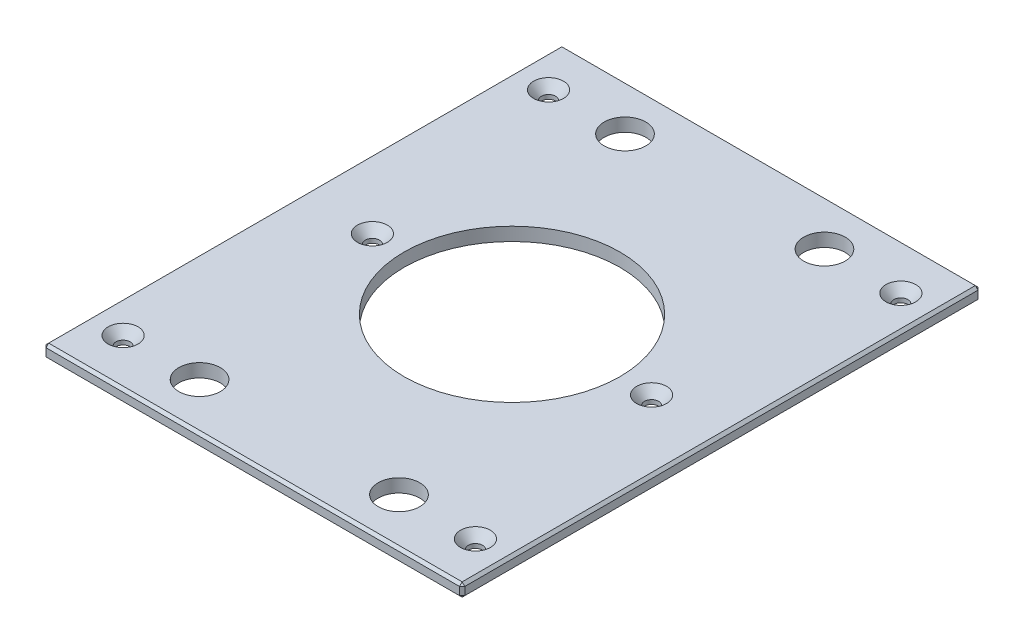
ISO-10303-21;
HEADER;
FILE_DESCRIPTION(('STEP AP214'),'2;1');
FILE_NAME('part.step','',(''),(''),'','','');
FILE_SCHEMA(('AUTOMOTIVE_DESIGN { 1 0 10303 214 1 1 1 1 }'));
ENDSEC;
DATA;
#1=APPLICATION_CONTEXT('core data for automotive mechanical design processes');
#2=APPLICATION_PROTOCOL_DEFINITION('international standard','automotive_design',2000,#1);
#3=PRODUCT_CONTEXT('',#1,'mechanical');
#4=PRODUCT('Part','Part','',(#3));
#5=PRODUCT_RELATED_PRODUCT_CATEGORY('part','',(#4));
#6=PRODUCT_DEFINITION_FORMATION('','',#4);
#7=PRODUCT_DEFINITION_CONTEXT('part definition',#1,'design');
#8=PRODUCT_DEFINITION('design','',#6,#7);
#9=PRODUCT_DEFINITION_SHAPE('','',#8);
#10=(LENGTH_UNIT() NAMED_UNIT(*) SI_UNIT(.MILLI.,.METRE.));
#11=(NAMED_UNIT(*) PLANE_ANGLE_UNIT() SI_UNIT($,.RADIAN.));
#12=(NAMED_UNIT(*) SI_UNIT($,.STERADIAN.) SOLID_ANGLE_UNIT());
#13=UNCERTAINTY_MEASURE_WITH_UNIT(LENGTH_MEASURE(1.E-05),#10,'distance_accuracy_value','');
#14=(GEOMETRIC_REPRESENTATION_CONTEXT(3) GLOBAL_UNCERTAINTY_ASSIGNED_CONTEXT((#13)) GLOBAL_UNIT_ASSIGNED_CONTEXT((#10,
#11,#12)) REPRESENTATION_CONTEXT('',''));
#15=CARTESIAN_POINT('',(0.,0.,0.));
#16=DIRECTION('',(0.,0.,1.));
#17=DIRECTION('',(1.,0.,0.));
#18=AXIS2_PLACEMENT_3D('',#15,#16,#17);
#19=CARTESIAN_POINT('',(-100.0125,6.35,-123.825));
#20=DIRECTION('',(1.,0.,0.));
#21=DIRECTION('',(0.,0.,-1.));
#22=AXIS2_PLACEMENT_3D('',#19,#20,#21);
#23=PLANE('',#22);
#24=DIRECTION('',(0.,0.,-1.));
#25=VECTOR('',#24,1.);
#26=CARTESIAN_POINT('',(-100.0125,5.08000000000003,-123.825));
#27=LINE('',#26,#25);
#28=CARTESIAN_POINT('',(-100.0125,5.08000000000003,122.555));
#29=VERTEX_POINT('',#28);
#30=CARTESIAN_POINT('',(-100.0125,5.08000000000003,-122.555));
#31=VERTEX_POINT('',#30);
#32=EDGE_CURVE('E135',#29,#31,#27,.T.);
#33=ORIENTED_EDGE('',*,*,#32,.T.);
#34=DIRECTION('',(0.,-1.,0.));
#35=VECTOR('',#34,1.);
#36=CARTESIAN_POINT('',(-100.0125,6.35,-122.555));
#37=LINE('',#36,#35);
#38=CARTESIAN_POINT('',(-100.0125,1.26999999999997,-122.555));
#39=VERTEX_POINT('',#38);
#40=EDGE_CURVE('E131',#31,#39,#37,.T.);
#41=ORIENTED_EDGE('',*,*,#40,.T.);
#42=DIRECTION('',(0.,0.,1.));
#43=VECTOR('',#42,1.);
#44=CARTESIAN_POINT('',(-100.0125,1.26999999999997,-123.825));
#45=LINE('',#44,#43);
#46=CARTESIAN_POINT('',(-100.0125,1.26999999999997,122.555));
#47=VERTEX_POINT('',#46);
#48=EDGE_CURVE('E126',#39,#47,#45,.T.);
#49=ORIENTED_EDGE('',*,*,#48,.T.);
#50=DIRECTION('',(0.,1.,0.));
#51=VECTOR('',#50,1.);
#52=CARTESIAN_POINT('',(-100.0125,6.35,122.555));
#53=LINE('',#52,#51);
#54=EDGE_CURVE('E128',#47,#29,#53,.T.);
#55=ORIENTED_EDGE('',*,*,#54,.T.);
#56=EDGE_LOOP('',(#33,#41,#49,#55));
#57=FACE_BOUND('',#56,.T.);
#58=ADVANCED_FACE('F35',(#57),#23,.F.);
#59=CARTESIAN_POINT('',(-100.0125,6.35,123.825));
#60=DIRECTION('',(0.,0.,-1.));
#61=DIRECTION('',(-1.,0.,0.));
#62=AXIS2_PLACEMENT_3D('',#59,#60,#61);
#63=PLANE('',#62);
#64=DIRECTION('',(1.,0.,0.));
#65=VECTOR('',#64,1.);
#66=CARTESIAN_POINT('',(-100.0125,1.26999999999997,123.825));
#67=LINE('',#66,#65);
#68=CARTESIAN_POINT('',(-98.7425000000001,1.26999999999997,123.825));
#69=VERTEX_POINT('',#68);
#70=CARTESIAN_POINT('',(98.7425000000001,1.26999999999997,123.825));
#71=VERTEX_POINT('',#70);
#72=EDGE_CURVE('E58',#69,#71,#67,.T.);
#73=ORIENTED_EDGE('',*,*,#72,.T.);
#74=DIRECTION('',(0.,1.,0.));
#75=VECTOR('',#74,1.);
#76=CARTESIAN_POINT('',(98.7425000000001,6.35,123.825));
#77=LINE('',#76,#75);
#78=CARTESIAN_POINT('',(98.7425000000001,5.08000000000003,123.825));
#79=VERTEX_POINT('',#78);
#80=EDGE_CURVE('E11',#71,#79,#77,.T.);
#81=ORIENTED_EDGE('',*,*,#80,.T.);
#82=DIRECTION('',(-1.,0.,0.));
#83=VECTOR('',#82,1.);
#84=CARTESIAN_POINT('',(-100.0125,5.08000000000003,123.825));
#85=LINE('',#84,#83);
#86=CARTESIAN_POINT('',(-98.7425000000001,5.08000000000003,123.825));
#87=VERTEX_POINT('',#86);
#88=EDGE_CURVE('E44',#79,#87,#85,.T.);
#89=ORIENTED_EDGE('',*,*,#88,.T.);
#90=DIRECTION('',(0.,-1.,0.));
#91=VECTOR('',#90,1.);
#92=CARTESIAN_POINT('',(-98.7425000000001,6.35,123.825));
#93=LINE('',#92,#91);
#94=EDGE_CURVE('E279',#87,#69,#93,.T.);
#95=ORIENTED_EDGE('',*,*,#94,.T.);
#96=EDGE_LOOP('',(#73,#81,#89,#95));
#97=FACE_BOUND('',#96,.T.);
#98=ADVANCED_FACE('F348',(#97),#63,.F.);
#99=CARTESIAN_POINT('',(100.0125,6.35,-123.825));
#100=DIRECTION('',(-1.,0.,0.));
#101=DIRECTION('',(0.,0.,1.));
#102=AXIS2_PLACEMENT_3D('',#99,#100,#101);
#103=PLANE('',#102);
#104=DIRECTION('',(0.,0.,-1.));
#105=VECTOR('',#104,1.);
#106=CARTESIAN_POINT('',(100.0125,1.26999999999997,-123.825));
#107=LINE('',#106,#105);
#108=CARTESIAN_POINT('',(100.0125,1.26999999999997,122.555));
#109=VERTEX_POINT('',#108);
#110=CARTESIAN_POINT('',(100.0125,1.26999999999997,-122.555));
#111=VERTEX_POINT('',#110);
#112=EDGE_CURVE('E274',#109,#111,#107,.T.);
#113=ORIENTED_EDGE('',*,*,#112,.T.);
#114=DIRECTION('',(0.,1.,0.));
#115=VECTOR('',#114,1.);
#116=CARTESIAN_POINT('',(100.0125,6.35,-122.555));
#117=LINE('',#116,#115);
#118=CARTESIAN_POINT('',(100.0125,5.08000000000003,-122.555));
#119=VERTEX_POINT('',#118);
#120=EDGE_CURVE('E276',#111,#119,#117,.T.);
#121=ORIENTED_EDGE('',*,*,#120,.T.);
#122=DIRECTION('',(0.,0.,1.));
#123=VECTOR('',#122,1.);
#124=CARTESIAN_POINT('',(100.0125,5.08000000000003,123.825));
#125=LINE('',#124,#123);
#126=CARTESIAN_POINT('',(100.0125,5.08000000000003,122.555));
#127=VERTEX_POINT('',#126);
#128=EDGE_CURVE('E272',#119,#127,#125,.T.);
#129=ORIENTED_EDGE('',*,*,#128,.T.);
#130=DIRECTION('',(0.,-1.,0.));
#131=VECTOR('',#130,1.);
#132=CARTESIAN_POINT('',(100.0125,6.35,122.555));
#133=LINE('',#132,#131);
#134=EDGE_CURVE('E270',#127,#109,#133,.T.);
#135=ORIENTED_EDGE('',*,*,#134,.T.);
#136=EDGE_LOOP('',(#113,#121,#129,#135));
#137=FACE_BOUND('',#136,.T.);
#138=ADVANCED_FACE('F335',(#137),#103,.F.);
#139=CARTESIAN_POINT('',(-100.0125,6.35,-123.825));
#140=DIRECTION('',(0.,0.,1.));
#141=DIRECTION('',(1.,0.,0.));
#142=AXIS2_PLACEMENT_3D('',#139,#140,#141);
#143=PLANE('',#142);
#144=DIRECTION('',(-1.,0.,0.));
#145=VECTOR('',#144,1.);
#146=CARTESIAN_POINT('',(-100.0125,1.26999999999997,-123.825));
#147=LINE('',#146,#145);
#148=CARTESIAN_POINT('',(98.7425000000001,1.26999999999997,-123.825));
#149=VERTEX_POINT('',#148);
#150=CARTESIAN_POINT('',(-98.7425000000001,1.26999999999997,-123.825));
#151=VERTEX_POINT('',#150);
#152=EDGE_CURVE('E246',#149,#151,#147,.T.);
#153=ORIENTED_EDGE('',*,*,#152,.T.);
#154=DIRECTION('',(0.,1.,0.));
#155=VECTOR('',#154,1.);
#156=CARTESIAN_POINT('',(-98.7425000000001,6.35,-123.825));
#157=LINE('',#156,#155);
#158=CARTESIAN_POINT('',(-98.7425000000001,5.08000000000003,-123.825));
#159=VERTEX_POINT('',#158);
#160=EDGE_CURVE('E250',#151,#159,#157,.T.);
#161=ORIENTED_EDGE('',*,*,#160,.T.);
#162=DIRECTION('',(1.,0.,0.));
#163=VECTOR('',#162,1.);
#164=CARTESIAN_POINT('',(100.0125,5.08000000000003,-123.825));
#165=LINE('',#164,#163);
#166=CARTESIAN_POINT('',(98.7425000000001,5.08000000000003,-123.825));
#167=VERTEX_POINT('',#166);
#168=EDGE_CURVE('E248',#159,#167,#165,.T.);
#169=ORIENTED_EDGE('',*,*,#168,.T.);
#170=DIRECTION('',(0.,-1.,0.));
#171=VECTOR('',#170,1.);
#172=CARTESIAN_POINT('',(98.7425000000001,6.35,-123.825));
#173=LINE('',#172,#171);
#174=EDGE_CURVE('E244',#167,#149,#173,.T.);
#175=ORIENTED_EDGE('',*,*,#174,.T.);
#176=EDGE_LOOP('',(#153,#161,#169,#175));
#177=FACE_BOUND('',#176,.T.);
#178=ADVANCED_FACE('F309',(#177),#143,.F.);
#179=CARTESIAN_POINT('',(0.,6.35,0.));
#180=DIRECTION('',(0.,1.,0.));
#181=DIRECTION('',(0.,0.,1.));
#182=AXIS2_PLACEMENT_3D('',#179,#180,#181);
#183=PLANE('',#182);
#184=CARTESIAN_POINT('',(84.1375,6.35,-101.6));
#185=DIRECTION('',(0.,1.,0.));
#186=DIRECTION('',(0.,0.,1.));
#187=AXIS2_PLACEMENT_3D('',#184,#185,#186);
#188=CIRCLE('',#187,7.1374);
#189=CARTESIAN_POINT('',(84.1375,6.35,-94.4626));
#190=VERTEX_POINT('',#189);
#191=EDGE_CURVE('E752',#190,#190,#188,.T.);
#192=ORIENTED_EDGE('',*,*,#191,.F.);
#193=EDGE_LOOP('',(#192));
#194=FACE_BOUND('',#193,.T.);
#195=CARTESIAN_POINT('',(84.1375,6.35,101.6));
#196=DIRECTION('',(0.,1.,0.));
#197=DIRECTION('',(0.,0.,1.));
#198=AXIS2_PLACEMENT_3D('',#195,#196,#197);
#199=CIRCLE('',#198,7.1374);
#200=CARTESIAN_POINT('',(84.1375,6.35,108.7374));
#201=VERTEX_POINT('',#200);
#202=EDGE_CURVE('E756',#201,#201,#199,.T.);
#203=ORIENTED_EDGE('',*,*,#202,.F.);
#204=EDGE_LOOP('',(#203));
#205=FACE_BOUND('',#204,.T.);
#206=CARTESIAN_POINT('',(-84.1375,6.35,101.6));
#207=DIRECTION('',(0.,1.,0.));
#208=DIRECTION('',(0.,0.,1.));
#209=AXIS2_PLACEMENT_3D('',#206,#207,#208);
#210=CIRCLE('',#209,7.1374);
#211=CARTESIAN_POINT('',(-84.1375,6.35,108.7374));
#212=VERTEX_POINT('',#211);
#213=EDGE_CURVE('E760',#212,#212,#210,.T.);
#214=ORIENTED_EDGE('',*,*,#213,.F.);
#215=EDGE_LOOP('',(#214));
#216=FACE_BOUND('',#215,.T.);
#217=CARTESIAN_POINT('',(-66.675,6.35,0.));
#218=DIRECTION('',(0.,1.,0.));
#219=DIRECTION('',(0.,0.,1.));
#220=AXIS2_PLACEMENT_3D('',#217,#218,#219);
#221=CIRCLE('',#220,7.1374);
#222=CARTESIAN_POINT('',(-66.675,6.35,7.1374));
#223=VERTEX_POINT('',#222);
#224=EDGE_CURVE('E764',#223,#223,#221,.T.);
#225=ORIENTED_EDGE('',*,*,#224,.F.);
#226=EDGE_LOOP('',(#225));
#227=FACE_BOUND('',#226,.T.);
#228=CARTESIAN_POINT('',(66.675,6.35,0.));
#229=DIRECTION('',(0.,1.,0.));
#230=DIRECTION('',(0.,0.,1.));
#231=AXIS2_PLACEMENT_3D('',#228,#229,#230);
#232=CIRCLE('',#231,7.1374);
#233=CARTESIAN_POINT('',(66.675,6.35,7.1374));
#234=VERTEX_POINT('',#233);
#235=EDGE_CURVE('E768',#234,#234,#232,.T.);
#236=ORIENTED_EDGE('',*,*,#235,.F.);
#237=EDGE_LOOP('',(#236));
#238=FACE_BOUND('',#237,.T.);
#239=CARTESIAN_POINT('',(-84.1375,6.35,-101.6));
#240=DIRECTION('',(0.,1.,0.));
#241=DIRECTION('',(0.,0.,1.));
#242=AXIS2_PLACEMENT_3D('',#239,#240,#241);
#243=CIRCLE('',#242,7.1374);
#244=CARTESIAN_POINT('',(-84.1375,6.35,-94.4626));
#245=VERTEX_POINT('',#244);
#246=EDGE_CURVE('E771',#245,#245,#243,.T.);
#247=ORIENTED_EDGE('',*,*,#246,.F.);
#248=EDGE_LOOP('',(#247));
#249=FACE_BOUND('',#248,.T.);
#250=DIRECTION('',(0.,0.,-1.));
#251=VECTOR('',#250,1.);
#252=CARTESIAN_POINT('',(98.7425000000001,6.35,-123.825));
#253=LINE('',#252,#251);
#254=CARTESIAN_POINT('',(98.7425000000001,6.35,122.555));
#255=VERTEX_POINT('',#254);
#256=CARTESIAN_POINT('',(98.7425000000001,6.35,-122.555));
#257=VERTEX_POINT('',#256);
#258=EDGE_CURVE('E257',#255,#257,#253,.T.);
#259=ORIENTED_EDGE('',*,*,#258,.T.);
#260=DIRECTION('',(-1.,0.,0.));
#261=VECTOR('',#260,1.);
#262=CARTESIAN_POINT('',(-100.0125,6.35,-122.555));
#263=LINE('',#262,#261);
#264=CARTESIAN_POINT('',(-98.7425000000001,6.35,-122.555));
#265=VERTEX_POINT('',#264);
#266=EDGE_CURVE('E259',#257,#265,#263,.T.);
#267=ORIENTED_EDGE('',*,*,#266,.T.);
#268=DIRECTION('',(0.,0.,1.));
#269=VECTOR('',#268,1.);
#270=CARTESIAN_POINT('',(-98.7425000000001,6.35,123.825));
#271=LINE('',#270,#269);
#272=CARTESIAN_POINT('',(-98.7425000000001,6.35,122.555));
#273=VERTEX_POINT('',#272);
#274=EDGE_CURVE('E255',#265,#273,#271,.T.);
#275=ORIENTED_EDGE('',*,*,#274,.T.);
#276=DIRECTION('',(1.,0.,0.));
#277=VECTOR('',#276,1.);
#278=CARTESIAN_POINT('',(100.0125,6.35,122.555));
#279=LINE('',#278,#277);
#280=EDGE_CURVE('E253',#273,#255,#279,.T.);
#281=ORIENTED_EDGE('',*,*,#280,.T.);
#282=EDGE_LOOP('',(#259,#267,#275,#281));
#283=FACE_BOUND('',#282,.T.);
#284=CARTESIAN_POINT('',(47.625,6.35,-101.6));
#285=DIRECTION('',(0.,1.,0.));
#286=DIRECTION('',(0.,0.,1.));
#287=AXIS2_PLACEMENT_3D('',#284,#285,#286);
#288=CIRCLE('',#287,9.921875);
#289=CARTESIAN_POINT('',(47.625,6.35,-91.678125));
#290=VERTEX_POINT('',#289);
#291=EDGE_CURVE('E204',#290,#290,#288,.T.);
#292=ORIENTED_EDGE('',*,*,#291,.F.);
#293=EDGE_LOOP('',(#292));
#294=FACE_BOUND('',#293,.T.);
#295=CARTESIAN_POINT('',(-47.625,6.35,-101.6));
#296=DIRECTION('',(0.,1.,0.));
#297=DIRECTION('',(0.,0.,1.));
#298=AXIS2_PLACEMENT_3D('',#295,#296,#297);
#299=CIRCLE('',#298,9.921875);
#300=CARTESIAN_POINT('',(-47.625,6.35,-91.678125));
#301=VERTEX_POINT('',#300);
#302=EDGE_CURVE('E214',#301,#301,#299,.T.);
#303=ORIENTED_EDGE('',*,*,#302,.F.);
#304=EDGE_LOOP('',(#303));
#305=FACE_BOUND('',#304,.T.);
#306=CARTESIAN_POINT('',(47.625,6.35,101.6));
#307=DIRECTION('',(0.,1.,0.));
#308=DIRECTION('',(0.,0.,1.));
#309=AXIS2_PLACEMENT_3D('',#306,#307,#308);
#310=CIRCLE('',#309,9.921875);
#311=CARTESIAN_POINT('',(47.625,6.35,111.521875));
#312=VERTEX_POINT('',#311);
#313=EDGE_CURVE('E225',#312,#312,#310,.T.);
#314=ORIENTED_EDGE('',*,*,#313,.F.);
#315=EDGE_LOOP('',(#314));
#316=FACE_BOUND('',#315,.T.);
#317=CARTESIAN_POINT('',(-47.625,6.35,101.6));
#318=DIRECTION('',(0.,1.,0.));
#319=DIRECTION('',(0.,0.,1.));
#320=AXIS2_PLACEMENT_3D('',#317,#318,#319);
#321=CIRCLE('',#320,9.921875);
#322=CARTESIAN_POINT('',(-47.625,6.35,111.521875));
#323=VERTEX_POINT('',#322);
#324=EDGE_CURVE('E231',#323,#323,#321,.T.);
#325=ORIENTED_EDGE('',*,*,#324,.F.);
#326=EDGE_LOOP('',(#325));
#327=FACE_BOUND('',#326,.T.);
#328=CARTESIAN_POINT('',(0.,6.35,0.));
#329=DIRECTION('',(0.,1.,0.));
#330=DIRECTION('',(0.,0.,1.));
#331=AXIS2_PLACEMENT_3D('',#328,#329,#330);
#332=CIRCLE('',#331,51.562);
#333=CARTESIAN_POINT('',(0.,6.35,51.562));
#334=VERTEX_POINT('',#333);
#335=EDGE_CURVE('E237',#334,#334,#332,.T.);
#336=ORIENTED_EDGE('',*,*,#335,.F.);
#337=EDGE_LOOP('',(#336));
#338=FACE_BOUND('',#337,.T.);
#339=ADVANCED_FACE('F357',(#194,#205,#216,#227,#238,#249,#283,#294,#305,#316,#327,#338),#183,.T.);
#340=CARTESIAN_POINT('',(0.,0.,0.));
#341=DIRECTION('',(0.,1.,0.));
#342=DIRECTION('',(0.,0.,1.));
#343=AXIS2_PLACEMENT_3D('',#340,#341,#342);
#344=PLANE('',#343);
#345=CARTESIAN_POINT('',(84.1375,0.,-101.6));
#346=DIRECTION('',(0.,1.,0.));
#347=DIRECTION('',(0.,0.,1.));
#348=AXIS2_PLACEMENT_3D('',#345,#346,#347);
#349=CIRCLE('',#348,3.3782);
#350=CARTESIAN_POINT('',(84.1375,0.,-98.2218));
#351=VERTEX_POINT('',#350);
#352=EDGE_CURVE('E805',#351,#351,#349,.T.);
#353=ORIENTED_EDGE('',*,*,#352,.T.);
#354=EDGE_LOOP('',(#353));
#355=FACE_BOUND('',#354,.T.);
#356=CARTESIAN_POINT('',(84.1375,0.,101.6));
#357=DIRECTION('',(0.,1.,0.));
#358=DIRECTION('',(0.,0.,1.));
#359=AXIS2_PLACEMENT_3D('',#356,#357,#358);
#360=CIRCLE('',#359,3.3782);
#361=CARTESIAN_POINT('',(84.1375,0.,104.9782));
#362=VERTEX_POINT('',#361);
#363=EDGE_CURVE('E798',#362,#362,#360,.T.);
#364=ORIENTED_EDGE('',*,*,#363,.T.);
#365=EDGE_LOOP('',(#364));
#366=FACE_BOUND('',#365,.T.);
#367=CARTESIAN_POINT('',(-84.1375,0.,101.6));
#368=DIRECTION('',(0.,1.,0.));
#369=DIRECTION('',(0.,0.,1.));
#370=AXIS2_PLACEMENT_3D('',#367,#368,#369);
#371=CIRCLE('',#370,3.3782);
#372=CARTESIAN_POINT('',(-84.1375,0.,104.9782));
#373=VERTEX_POINT('',#372);
#374=EDGE_CURVE('E791',#373,#373,#371,.T.);
#375=ORIENTED_EDGE('',*,*,#374,.T.);
#376=EDGE_LOOP('',(#375));
#377=FACE_BOUND('',#376,.T.);
#378=CARTESIAN_POINT('',(-66.675,0.,0.));
#379=DIRECTION('',(0.,1.,0.));
#380=DIRECTION('',(0.,0.,1.));
#381=AXIS2_PLACEMENT_3D('',#378,#379,#380);
#382=CIRCLE('',#381,3.3782);
#383=CARTESIAN_POINT('',(-66.675,0.,3.3782));
#384=VERTEX_POINT('',#383);
#385=EDGE_CURVE('E784',#384,#384,#382,.T.);
#386=ORIENTED_EDGE('',*,*,#385,.T.);
#387=EDGE_LOOP('',(#386));
#388=FACE_BOUND('',#387,.T.);
#389=CARTESIAN_POINT('',(66.675,0.,0.));
#390=DIRECTION('',(0.,1.,0.));
#391=DIRECTION('',(0.,0.,1.));
#392=AXIS2_PLACEMENT_3D('',#389,#390,#391);
#393=CIRCLE('',#392,3.3782);
#394=CARTESIAN_POINT('',(66.675,0.,3.3782));
#395=VERTEX_POINT('',#394);
#396=EDGE_CURVE('E774',#395,#395,#393,.T.);
#397=ORIENTED_EDGE('',*,*,#396,.T.);
#398=EDGE_LOOP('',(#397));
#399=FACE_BOUND('',#398,.T.);
#400=CARTESIAN_POINT('',(-84.1375,0.,-101.6));
#401=DIRECTION('',(0.,1.,0.));
#402=DIRECTION('',(0.,0.,1.));
#403=AXIS2_PLACEMENT_3D('',#400,#401,#402);
#404=CIRCLE('',#403,3.3782);
#405=CARTESIAN_POINT('',(-84.1375,0.,-98.2218));
#406=VERTEX_POINT('',#405);
#407=EDGE_CURVE('E217',#406,#406,#404,.T.);
#408=ORIENTED_EDGE('',*,*,#407,.T.);
#409=EDGE_LOOP('',(#408));
#410=FACE_BOUND('',#409,.T.);
#411=DIRECTION('',(0.,0.,-1.));
#412=VECTOR('',#411,1.);
#413=CARTESIAN_POINT('',(-98.7425000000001,0.,0.));
#414=LINE('',#413,#412);
#415=CARTESIAN_POINT('',(-98.7425000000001,0.,122.555));
#416=VERTEX_POINT('',#415);
#417=CARTESIAN_POINT('',(-98.7425000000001,0.,-122.555));
#418=VERTEX_POINT('',#417);
#419=EDGE_CURVE('E158',#416,#418,#414,.T.);
#420=ORIENTED_EDGE('',*,*,#419,.T.);
#421=DIRECTION('',(1.,0.,0.));
#422=VECTOR('',#421,1.);
#423=CARTESIAN_POINT('',(0.,0.,-122.555));
#424=LINE('',#423,#422);
#425=CARTESIAN_POINT('',(98.7425000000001,0.,-122.555));
#426=VERTEX_POINT('',#425);
#427=EDGE_CURVE('E267',#418,#426,#424,.T.);
#428=ORIENTED_EDGE('',*,*,#427,.T.);
#429=DIRECTION('',(0.,0.,1.));
#430=VECTOR('',#429,1.);
#431=CARTESIAN_POINT('',(98.7425000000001,0.,0.));
#432=LINE('',#431,#430);
#433=CARTESIAN_POINT('',(98.7425000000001,0.,122.555));
#434=VERTEX_POINT('',#433);
#435=EDGE_CURVE('E265',#426,#434,#432,.T.);
#436=ORIENTED_EDGE('',*,*,#435,.T.);
#437=DIRECTION('',(-1.,0.,0.));
#438=VECTOR('',#437,1.);
#439=CARTESIAN_POINT('',(0.,0.,122.555));
#440=LINE('',#439,#438);
#441=EDGE_CURVE('E262',#434,#416,#440,.T.);
#442=ORIENTED_EDGE('',*,*,#441,.T.);
#443=EDGE_LOOP('',(#420,#428,#436,#442));
#444=FACE_BOUND('',#443,.T.);
#445=CARTESIAN_POINT('',(47.625,0.,-101.6));
#446=DIRECTION('',(0.,1.,0.));
#447=DIRECTION('',(0.,0.,1.));
#448=AXIS2_PLACEMENT_3D('',#445,#446,#447);
#449=CIRCLE('',#448,9.921875);
#450=CARTESIAN_POINT('',(47.625,0.,-91.678125));
#451=VERTEX_POINT('',#450);
#452=EDGE_CURVE('E209',#451,#451,#449,.T.);
#453=ORIENTED_EDGE('',*,*,#452,.T.);
#454=EDGE_LOOP('',(#453));
#455=FACE_BOUND('',#454,.T.);
#456=CARTESIAN_POINT('',(-47.625,0.,-101.6));
#457=DIRECTION('',(0.,1.,0.));
#458=DIRECTION('',(0.,0.,1.));
#459=AXIS2_PLACEMENT_3D('',#456,#457,#458);
#460=CIRCLE('',#459,9.921875);
#461=CARTESIAN_POINT('',(-47.625,0.,-91.678125));
#462=VERTEX_POINT('',#461);
#463=EDGE_CURVE('E222',#462,#462,#460,.T.);
#464=ORIENTED_EDGE('',*,*,#463,.T.);
#465=EDGE_LOOP('',(#464));
#466=FACE_BOUND('',#465,.T.);
#467=CARTESIAN_POINT('',(47.625,0.,101.6));
#468=DIRECTION('',(0.,1.,0.));
#469=DIRECTION('',(0.,0.,1.));
#470=AXIS2_PLACEMENT_3D('',#467,#468,#469);
#471=CIRCLE('',#470,9.921875);
#472=CARTESIAN_POINT('',(47.625,0.,111.521875));
#473=VERTEX_POINT('',#472);
#474=EDGE_CURVE('E228',#473,#473,#471,.T.);
#475=ORIENTED_EDGE('',*,*,#474,.T.);
#476=EDGE_LOOP('',(#475));
#477=FACE_BOUND('',#476,.T.);
#478=CARTESIAN_POINT('',(-47.625,0.,101.6));
#479=DIRECTION('',(0.,1.,0.));
#480=DIRECTION('',(0.,0.,1.));
#481=AXIS2_PLACEMENT_3D('',#478,#479,#480);
#482=CIRCLE('',#481,9.921875);
#483=CARTESIAN_POINT('',(-47.625,0.,111.521875));
#484=VERTEX_POINT('',#483);
#485=EDGE_CURVE('E234',#484,#484,#482,.T.);
#486=ORIENTED_EDGE('',*,*,#485,.T.);
#487=EDGE_LOOP('',(#486));
#488=FACE_BOUND('',#487,.T.);
#489=CARTESIAN_POINT('',(0.,0.,0.));
#490=DIRECTION('',(0.,1.,0.));
#491=DIRECTION('',(0.,0.,1.));
#492=AXIS2_PLACEMENT_3D('',#489,#490,#491);
#493=CIRCLE('',#492,51.562);
#494=CARTESIAN_POINT('',(0.,0.,51.562));
#495=VERTEX_POINT('',#494);
#496=EDGE_CURVE('E147',#495,#495,#493,.T.);
#497=ORIENTED_EDGE('',*,*,#496,.T.);
#498=EDGE_LOOP('',(#497));
#499=FACE_BOUND('',#498,.T.);
#500=ADVANCED_FACE('F322',(#355,#366,#377,#388,#399,#410,#444,#455,#466,#477,#488,#499),#344,.F.);
#501=CARTESIAN_POINT('',(0.,0.,0.));
#502=DIRECTION('',(0.,1.,0.));
#503=DIRECTION('',(0.,0.,1.));
#504=AXIS2_PLACEMENT_3D('',#501,#502,#503);
#505=CYLINDRICAL_SURFACE('',#504,51.562);
#506=ORIENTED_EDGE('',*,*,#496,.F.);
#507=EDGE_LOOP('',(#506));
#508=FACE_BOUND('',#507,.T.);
#509=ORIENTED_EDGE('',*,*,#335,.T.);
#510=EDGE_LOOP('',(#509));
#511=FACE_BOUND('',#510,.T.);
#512=ADVANCED_FACE('F691',(#508,#511),#505,.F.);
#513=CARTESIAN_POINT('',(-47.625,6.35,101.6));
#514=DIRECTION('',(0.,1.,0.));
#515=DIRECTION('',(0.,0.,1.));
#516=AXIS2_PLACEMENT_3D('',#513,#514,#515);
#517=CYLINDRICAL_SURFACE('',#516,9.921875);
#518=ORIENTED_EDGE('',*,*,#485,.F.);
#519=EDGE_LOOP('',(#518));
#520=FACE_BOUND('',#519,.T.);
#521=ORIENTED_EDGE('',*,*,#324,.T.);
#522=EDGE_LOOP('',(#521));
#523=FACE_BOUND('',#522,.T.);
#524=ADVANCED_FACE('F682',(#520,#523),#517,.F.);
#525=CARTESIAN_POINT('',(47.625,6.35,101.6));
#526=DIRECTION('',(0.,1.,0.));
#527=DIRECTION('',(0.,0.,1.));
#528=AXIS2_PLACEMENT_3D('',#525,#526,#527);
#529=CYLINDRICAL_SURFACE('',#528,9.921875);
#530=ORIENTED_EDGE('',*,*,#474,.F.);
#531=EDGE_LOOP('',(#530));
#532=FACE_BOUND('',#531,.T.);
#533=ORIENTED_EDGE('',*,*,#313,.T.);
#534=EDGE_LOOP('',(#533));
#535=FACE_BOUND('',#534,.T.);
#536=ADVANCED_FACE('F673',(#532,#535),#529,.F.);
#537=CARTESIAN_POINT('',(-47.625,6.35,-101.6));
#538=DIRECTION('',(0.,1.,0.));
#539=DIRECTION('',(0.,0.,1.));
#540=AXIS2_PLACEMENT_3D('',#537,#538,#539);
#541=CYLINDRICAL_SURFACE('',#540,9.921875);
#542=ORIENTED_EDGE('',*,*,#463,.F.);
#543=EDGE_LOOP('',(#542));
#544=FACE_BOUND('',#543,.T.);
#545=ORIENTED_EDGE('',*,*,#302,.T.);
#546=EDGE_LOOP('',(#545));
#547=FACE_BOUND('',#546,.T.);
#548=ADVANCED_FACE('F663',(#544,#547),#541,.F.);
#549=CARTESIAN_POINT('',(47.625,6.35,-101.6));
#550=DIRECTION('',(0.,1.,0.));
#551=DIRECTION('',(0.,0.,1.));
#552=AXIS2_PLACEMENT_3D('',#549,#550,#551);
#553=CYLINDRICAL_SURFACE('',#552,9.921875);
#554=ORIENTED_EDGE('',*,*,#452,.F.);
#555=EDGE_LOOP('',(#554));
#556=FACE_BOUND('',#555,.T.);
#557=ORIENTED_EDGE('',*,*,#291,.T.);
#558=EDGE_LOOP('',(#557));
#559=FACE_BOUND('',#558,.T.);
#560=ADVANCED_FACE('F366',(#556,#559),#553,.F.);
#561=CARTESIAN_POINT('',(100.0125,6.35,122.555));
#562=DIRECTION('',(-0.707106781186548,0.,-0.707106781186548));
#563=DIRECTION('',(0.,-1.,0.));
#564=AXIS2_PLACEMENT_3D('',#561,#562,#563);
#565=PLANE('',#564);
#566=DIRECTION('',(-0.707106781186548,0.,0.707106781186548));
#567=VECTOR('',#566,1.);
#568=CARTESIAN_POINT('',(100.0125,5.08000000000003,122.555));
#569=LINE('',#568,#567);
#570=EDGE_CURVE('E39',#79,#127,#569,.F.);
#571=ORIENTED_EDGE('',*,*,#570,.F.);
#572=ORIENTED_EDGE('',*,*,#80,.F.);
#573=DIRECTION('',(0.707106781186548,0.,-0.707106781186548));
#574=VECTOR('',#573,1.);
#575=CARTESIAN_POINT('',(99.3775000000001,1.26999999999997,123.19));
#576=LINE('',#575,#574);
#577=EDGE_CURVE('E197',#109,#71,#576,.F.);
#578=ORIENTED_EDGE('',*,*,#577,.F.);
#579=ORIENTED_EDGE('',*,*,#134,.F.);
#580=EDGE_LOOP('',(#571,#572,#578,#579));
#581=FACE_BOUND('',#580,.T.);
#582=ADVANCED_FACE('F37',(#581),#565,.F.);
#583=CARTESIAN_POINT('',(100.0125,5.08000000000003,122.555));
#584=DIRECTION('',(0.577350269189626,0.577350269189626,0.577350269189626));
#585=DIRECTION('',(0.707106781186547,0.,-0.707106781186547));
#586=AXIS2_PLACEMENT_3D('',#583,#584,#585);
#587=PLANE('',#586);
#588=DIRECTION('',(0.,-0.707106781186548,0.707106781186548));
#589=VECTOR('',#588,1.);
#590=CARTESIAN_POINT('',(98.7425000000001,5.71500000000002,123.19));
#591=LINE('',#590,#589);
#592=EDGE_CURVE('E193',#79,#255,#591,.F.);
#593=ORIENTED_EDGE('',*,*,#592,.F.);
#594=ORIENTED_EDGE('',*,*,#570,.T.);
#595=DIRECTION('',(-0.707106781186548,0.707106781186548,0.));
#596=VECTOR('',#595,1.);
#597=CARTESIAN_POINT('',(100.0125,5.08000000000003,122.555));
#598=LINE('',#597,#596);
#599=EDGE_CURVE('E195',#255,#127,#598,.F.);
#600=ORIENTED_EDGE('',*,*,#599,.F.);
#601=EDGE_LOOP('',(#593,#594,#600));
#602=FACE_BOUND('',#601,.T.);
#603=ADVANCED_FACE('F359',(#602),#587,.T.);
#604=CARTESIAN_POINT('',(98.7425000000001,0.,122.555));
#605=DIRECTION('',(0.577350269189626,-0.577350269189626,0.577350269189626));
#606=DIRECTION('',(0.707106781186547,0.,-0.707106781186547));
#607=AXIS2_PLACEMENT_3D('',#604,#605,#606);
#608=PLANE('',#607);
#609=DIRECTION('',(-0.707106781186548,-0.707106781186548,0.));
#610=VECTOR('',#609,1.);
#611=CARTESIAN_POINT('',(98.7425000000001,0.,122.555));
#612=LINE('',#611,#610);
#613=EDGE_CURVE('E187',#109,#434,#612,.T.);
#614=ORIENTED_EDGE('',*,*,#613,.F.);
#615=ORIENTED_EDGE('',*,*,#577,.T.);
#616=DIRECTION('',(0.,0.707106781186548,0.707106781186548));
#617=VECTOR('',#616,1.);
#618=CARTESIAN_POINT('',(98.7425000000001,0.,122.555));
#619=LINE('',#618,#617);
#620=EDGE_CURVE('E190',#434,#71,#619,.T.);
#621=ORIENTED_EDGE('',*,*,#620,.F.);
#622=EDGE_LOOP('',(#614,#615,#621));
#623=FACE_BOUND('',#622,.T.);
#624=ADVANCED_FACE('F328',(#623),#608,.T.);
#625=CARTESIAN_POINT('',(98.7425000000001,6.35,0.));
#626=DIRECTION('',(0.707106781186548,0.707106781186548,0.));
#627=DIRECTION('',(0.,0.,1.));
#628=AXIS2_PLACEMENT_3D('',#625,#626,#627);
#629=PLANE('',#628);
#630=ORIENTED_EDGE('',*,*,#599,.T.);
#631=ORIENTED_EDGE('',*,*,#128,.F.);
#632=DIRECTION('',(0.707106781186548,-0.707106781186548,0.));
#633=VECTOR('',#632,1.);
#634=CARTESIAN_POINT('',(99.3775000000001,5.71500000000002,-122.555));
#635=LINE('',#634,#633);
#636=EDGE_CURVE('E182',#257,#119,#635,.T.);
#637=ORIENTED_EDGE('',*,*,#636,.F.);
#638=ORIENTED_EDGE('',*,*,#258,.F.);
#639=EDGE_LOOP('',(#630,#631,#637,#638));
#640=FACE_BOUND('',#639,.T.);
#641=ADVANCED_FACE('F345',(#640),#629,.T.);
#642=CARTESIAN_POINT('',(0.,6.35,122.555));
#643=DIRECTION('',(0.,0.707106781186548,0.707106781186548));
#644=DIRECTION('',(-1.,0.,0.));
#645=AXIS2_PLACEMENT_3D('',#642,#643,#644);
#646=PLANE('',#645);
#647=ORIENTED_EDGE('',*,*,#592,.T.);
#648=ORIENTED_EDGE('',*,*,#280,.F.);
#649=DIRECTION('',(0.,0.707106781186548,-0.707106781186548));
#650=VECTOR('',#649,1.);
#651=CARTESIAN_POINT('',(-98.7425000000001,6.35,122.555));
#652=LINE('',#651,#650);
#653=EDGE_CURVE('E179',#87,#273,#652,.T.);
#654=ORIENTED_EDGE('',*,*,#653,.F.);
#655=ORIENTED_EDGE('',*,*,#88,.F.);
#656=EDGE_LOOP('',(#647,#648,#654,#655));
#657=FACE_BOUND('',#656,.T.);
#658=ADVANCED_FACE('F350',(#657),#646,.T.);
#659=CARTESIAN_POINT('',(-98.7425000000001,6.35,123.825));
#660=DIRECTION('',(0.707106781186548,0.,-0.707106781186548));
#661=DIRECTION('',(0.,-1.,0.));
#662=AXIS2_PLACEMENT_3D('',#659,#660,#661);
#663=PLANE('',#662);
#664=DIRECTION('',(0.707106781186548,0.,0.707106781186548));
#665=VECTOR('',#664,1.);
#666=CARTESIAN_POINT('',(-100.0125,1.26999999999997,122.555));
#667=LINE('',#666,#665);
#668=EDGE_CURVE('E142',#69,#47,#667,.F.);
#669=ORIENTED_EDGE('',*,*,#668,.F.);
#670=ORIENTED_EDGE('',*,*,#94,.F.);
#671=DIRECTION('',(-0.707106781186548,0.,-0.707106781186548));
#672=VECTOR('',#671,1.);
#673=CARTESIAN_POINT('',(-99.3775000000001,5.08000000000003,123.19));
#674=LINE('',#673,#672);
#675=EDGE_CURVE('E145',#29,#87,#674,.F.);
#676=ORIENTED_EDGE('',*,*,#675,.F.);
#677=ORIENTED_EDGE('',*,*,#54,.F.);
#678=EDGE_LOOP('',(#669,#670,#676,#677));
#679=FACE_BOUND('',#678,.T.);
#680=ADVANCED_FACE('F140',(#679),#663,.F.);
#681=CARTESIAN_POINT('',(-100.0125,1.26999999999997,123.825));
#682=DIRECTION('',(0.,0.707106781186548,-0.707106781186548));
#683=DIRECTION('',(1.,0.,0.));
#684=AXIS2_PLACEMENT_3D('',#681,#682,#683);
#685=PLANE('',#684);
#686=ORIENTED_EDGE('',*,*,#620,.T.);
#687=ORIENTED_EDGE('',*,*,#72,.F.);
#688=DIRECTION('',(0.,-0.707106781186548,-0.707106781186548));
#689=VECTOR('',#688,1.);
#690=CARTESIAN_POINT('',(-98.7425000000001,0.634999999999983,123.19));
#691=LINE('',#690,#689);
#692=EDGE_CURVE('E155',#416,#69,#691,.F.);
#693=ORIENTED_EDGE('',*,*,#692,.F.);
#694=ORIENTED_EDGE('',*,*,#441,.F.);
#695=EDGE_LOOP('',(#686,#687,#693,#694));
#696=FACE_BOUND('',#695,.T.);
#697=ADVANCED_FACE('F327',(#696),#685,.F.);
#698=CARTESIAN_POINT('',(100.0125,1.26999999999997,-123.825));
#699=DIRECTION('',(-0.707106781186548,0.707106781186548,0.));
#700=DIRECTION('',(0.,0.,-1.));
#701=AXIS2_PLACEMENT_3D('',#698,#699,#700);
#702=PLANE('',#701);
#703=ORIENTED_EDGE('',*,*,#613,.T.);
#704=ORIENTED_EDGE('',*,*,#435,.F.);
#705=DIRECTION('',(0.707106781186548,0.707106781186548,0.));
#706=VECTOR('',#705,1.);
#707=CARTESIAN_POINT('',(98.7425000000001,0.,-122.555));
#708=LINE('',#707,#706);
#709=EDGE_CURVE('E174',#111,#426,#708,.F.);
#710=ORIENTED_EDGE('',*,*,#709,.F.);
#711=ORIENTED_EDGE('',*,*,#112,.F.);
#712=EDGE_LOOP('',(#703,#704,#710,#711));
#713=FACE_BOUND('',#712,.T.);
#714=ADVANCED_FACE('F332',(#713),#702,.F.);
#715=CARTESIAN_POINT('',(98.7425000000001,6.35,-123.825));
#716=DIRECTION('',(-0.707106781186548,0.,0.707106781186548));
#717=DIRECTION('',(0.,-1.,0.));
#718=AXIS2_PLACEMENT_3D('',#715,#716,#717);
#719=PLANE('',#718);
#720=DIRECTION('',(0.707106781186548,0.,0.707106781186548));
#721=VECTOR('',#720,1.);
#722=CARTESIAN_POINT('',(98.7425000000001,5.08000000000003,-123.825));
#723=LINE('',#722,#721);
#724=EDGE_CURVE('E184',#119,#167,#723,.F.);
#725=ORIENTED_EDGE('',*,*,#724,.F.);
#726=ORIENTED_EDGE('',*,*,#120,.F.);
#727=DIRECTION('',(-0.707106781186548,0.,-0.707106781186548));
#728=VECTOR('',#727,1.);
#729=CARTESIAN_POINT('',(99.3775000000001,1.26999999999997,-123.19));
#730=LINE('',#729,#728);
#731=EDGE_CURVE('E171',#149,#111,#730,.F.);
#732=ORIENTED_EDGE('',*,*,#731,.F.);
#733=ORIENTED_EDGE('',*,*,#174,.F.);
#734=EDGE_LOOP('',(#725,#726,#732,#733));
#735=FACE_BOUND('',#734,.T.);
#736=ADVANCED_FACE('F340',(#735),#719,.F.);
#737=CARTESIAN_POINT('',(98.7425000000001,5.08000000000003,-123.825));
#738=DIRECTION('',(0.577350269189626,0.577350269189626,-0.577350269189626));
#739=DIRECTION('',(-0.707106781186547,0.,-0.707106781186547));
#740=AXIS2_PLACEMENT_3D('',#737,#738,#739);
#741=PLANE('',#740);
#742=ORIENTED_EDGE('',*,*,#636,.T.);
#743=ORIENTED_EDGE('',*,*,#724,.T.);
#744=DIRECTION('',(0.,0.707106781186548,0.707106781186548));
#745=VECTOR('',#744,1.);
#746=CARTESIAN_POINT('',(98.7425000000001,5.08000000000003,-123.825));
#747=LINE('',#746,#745);
#748=EDGE_CURVE('E163',#257,#167,#747,.F.);
#749=ORIENTED_EDGE('',*,*,#748,.F.);
#750=EDGE_LOOP('',(#742,#743,#749));
#751=FACE_BOUND('',#750,.T.);
#752=ADVANCED_FACE('F398',(#751),#741,.T.);
#753=CARTESIAN_POINT('',(-98.7425000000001,6.35,122.555));
#754=DIRECTION('',(-0.577350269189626,0.577350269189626,0.577350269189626));
#755=DIRECTION('',(0.707106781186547,0.,0.707106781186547));
#756=AXIS2_PLACEMENT_3D('',#753,#754,#755);
#757=PLANE('',#756);
#758=ORIENTED_EDGE('',*,*,#675,.T.);
#759=ORIENTED_EDGE('',*,*,#653,.T.);
#760=DIRECTION('',(-0.707106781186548,-0.707106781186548,0.));
#761=VECTOR('',#760,1.);
#762=CARTESIAN_POINT('',(-98.7425000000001,6.35,122.555));
#763=LINE('',#762,#761);
#764=EDGE_CURVE('E159',#29,#273,#763,.F.);
#765=ORIENTED_EDGE('',*,*,#764,.F.);
#766=EDGE_LOOP('',(#758,#759,#765));
#767=FACE_BOUND('',#766,.T.);
#768=ADVANCED_FACE('F352',(#767),#757,.T.);
#769=CARTESIAN_POINT('',(-100.0125,1.26999999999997,122.555));
#770=DIRECTION('',(-0.577350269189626,-0.577350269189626,0.577350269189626));
#771=DIRECTION('',(0.707106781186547,0.,0.707106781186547));
#772=AXIS2_PLACEMENT_3D('',#769,#770,#771);
#773=PLANE('',#772);
#774=ORIENTED_EDGE('',*,*,#692,.T.);
#775=ORIENTED_EDGE('',*,*,#668,.T.);
#776=DIRECTION('',(-0.707106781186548,0.707106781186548,0.));
#777=VECTOR('',#776,1.);
#778=CARTESIAN_POINT('',(-100.0125,1.26999999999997,122.555));
#779=LINE('',#778,#777);
#780=EDGE_CURVE('E152',#416,#47,#779,.T.);
#781=ORIENTED_EDGE('',*,*,#780,.F.);
#782=EDGE_LOOP('',(#774,#775,#781));
#783=FACE_BOUND('',#782,.T.);
#784=ADVANCED_FACE('F151',(#783),#773,.T.);
#785=CARTESIAN_POINT('',(98.7425000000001,0.,-122.555));
#786=DIRECTION('',(0.577350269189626,-0.577350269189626,-0.577350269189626));
#787=DIRECTION('',(-0.707106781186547,0.,-0.707106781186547));
#788=AXIS2_PLACEMENT_3D('',#785,#786,#787);
#789=PLANE('',#788);
#790=ORIENTED_EDGE('',*,*,#731,.T.);
#791=ORIENTED_EDGE('',*,*,#709,.T.);
#792=DIRECTION('',(0.,-0.707106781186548,0.707106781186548));
#793=VECTOR('',#792,1.);
#794=CARTESIAN_POINT('',(98.7425000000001,0.,-122.555));
#795=LINE('',#794,#793);
#796=EDGE_CURVE('E160',#149,#426,#795,.T.);
#797=ORIENTED_EDGE('',*,*,#796,.F.);
#798=EDGE_LOOP('',(#790,#791,#797));
#799=FACE_BOUND('',#798,.T.);
#800=ADVANCED_FACE('F390',(#799),#789,.T.);
#801=CARTESIAN_POINT('',(0.,6.35,-122.555));
#802=DIRECTION('',(0.,0.707106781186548,-0.707106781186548));
#803=DIRECTION('',(1.,0.,0.));
#804=AXIS2_PLACEMENT_3D('',#801,#802,#803);
#805=PLANE('',#804);
#806=ORIENTED_EDGE('',*,*,#748,.T.);
#807=ORIENTED_EDGE('',*,*,#168,.F.);
#808=DIRECTION('',(0.,-0.707106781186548,-0.707106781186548));
#809=VECTOR('',#808,1.);
#810=CARTESIAN_POINT('',(-98.7425000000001,5.08000000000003,-123.825));
#811=LINE('',#810,#809);
#812=EDGE_CURVE('E165',#265,#159,#811,.T.);
#813=ORIENTED_EDGE('',*,*,#812,.F.);
#814=ORIENTED_EDGE('',*,*,#266,.F.);
#815=EDGE_LOOP('',(#806,#807,#813,#814));
#816=FACE_BOUND('',#815,.T.);
#817=ADVANCED_FACE('F304',(#816),#805,.T.);
#818=CARTESIAN_POINT('',(-98.7425000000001,6.35,0.));
#819=DIRECTION('',(-0.707106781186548,0.707106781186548,0.));
#820=DIRECTION('',(0.,0.,-1.));
#821=AXIS2_PLACEMENT_3D('',#818,#819,#820);
#822=PLANE('',#821);
#823=ORIENTED_EDGE('',*,*,#764,.T.);
#824=ORIENTED_EDGE('',*,*,#274,.F.);
#825=DIRECTION('',(0.707106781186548,0.707106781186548,0.));
#826=VECTOR('',#825,1.);
#827=CARTESIAN_POINT('',(-99.3775000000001,5.71500000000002,-122.555));
#828=LINE('',#827,#826);
#829=EDGE_CURVE('E293',#31,#265,#828,.T.);
#830=ORIENTED_EDGE('',*,*,#829,.F.);
#831=ORIENTED_EDGE('',*,*,#32,.F.);
#832=EDGE_LOOP('',(#823,#824,#830,#831));
#833=FACE_BOUND('',#832,.T.);
#834=ADVANCED_FACE('F355',(#833),#822,.T.);
#835=CARTESIAN_POINT('',(-100.0125,1.26999999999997,-123.825));
#836=DIRECTION('',(0.707106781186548,0.707106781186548,0.));
#837=DIRECTION('',(0.,0.,1.));
#838=AXIS2_PLACEMENT_3D('',#835,#836,#837);
#839=PLANE('',#838);
#840=ORIENTED_EDGE('',*,*,#780,.T.);
#841=ORIENTED_EDGE('',*,*,#48,.F.);
#842=DIRECTION('',(0.707106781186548,-0.707106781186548,0.));
#843=VECTOR('',#842,1.);
#844=CARTESIAN_POINT('',(-100.0125,1.26999999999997,-122.555));
#845=LINE('',#844,#843);
#846=EDGE_CURVE('E290',#418,#39,#845,.F.);
#847=ORIENTED_EDGE('',*,*,#846,.F.);
#848=ORIENTED_EDGE('',*,*,#419,.F.);
#849=EDGE_LOOP('',(#840,#841,#847,#848));
#850=FACE_BOUND('',#849,.T.);
#851=ADVANCED_FACE('F157',(#850),#839,.F.);
#852=CARTESIAN_POINT('',(-100.0125,1.26999999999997,-123.825));
#853=DIRECTION('',(0.,0.707106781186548,0.707106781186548));
#854=DIRECTION('',(-1.,0.,0.));
#855=AXIS2_PLACEMENT_3D('',#852,#853,#854);
#856=PLANE('',#855);
#857=ORIENTED_EDGE('',*,*,#796,.T.);
#858=ORIENTED_EDGE('',*,*,#427,.F.);
#859=DIRECTION('',(0.,0.707106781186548,-0.707106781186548));
#860=VECTOR('',#859,1.);
#861=CARTESIAN_POINT('',(-98.7425000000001,0.634999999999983,-123.19));
#862=LINE('',#861,#860);
#863=EDGE_CURVE('E287',#151,#418,#862,.F.);
#864=ORIENTED_EDGE('',*,*,#863,.F.);
#865=ORIENTED_EDGE('',*,*,#152,.F.);
#866=EDGE_LOOP('',(#857,#858,#864,#865));
#867=FACE_BOUND('',#866,.T.);
#868=ADVANCED_FACE('F319',(#867),#856,.F.);
#869=CARTESIAN_POINT('',(-98.7425000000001,5.08000000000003,-123.825));
#870=DIRECTION('',(-0.577350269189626,0.577350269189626,-0.577350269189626));
#871=DIRECTION('',(-0.707106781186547,0.,0.707106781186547));
#872=AXIS2_PLACEMENT_3D('',#869,#870,#871);
#873=PLANE('',#872);
#874=ORIENTED_EDGE('',*,*,#829,.T.);
#875=ORIENTED_EDGE('',*,*,#812,.T.);
#876=DIRECTION('',(0.707106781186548,0.,-0.707106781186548));
#877=VECTOR('',#876,1.);
#878=CARTESIAN_POINT('',(-98.7425000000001,5.08000000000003,-123.825));
#879=LINE('',#878,#877);
#880=EDGE_CURVE('E285',#31,#159,#879,.T.);
#881=ORIENTED_EDGE('',*,*,#880,.F.);
#882=EDGE_LOOP('',(#874,#875,#881));
#883=FACE_BOUND('',#882,.T.);
#884=ADVANCED_FACE('F299',(#883),#873,.T.);
#885=CARTESIAN_POINT('',(-100.0125,1.26999999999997,-122.555));
#886=DIRECTION('',(-0.577350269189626,-0.577350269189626,-0.577350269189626));
#887=DIRECTION('',(-0.707106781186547,0.,0.707106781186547));
#888=AXIS2_PLACEMENT_3D('',#885,#886,#887);
#889=PLANE('',#888);
#890=ORIENTED_EDGE('',*,*,#863,.T.);
#891=ORIENTED_EDGE('',*,*,#846,.T.);
#892=DIRECTION('',(-0.707106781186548,0.,0.707106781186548));
#893=VECTOR('',#892,1.);
#894=CARTESIAN_POINT('',(-100.0125,1.26999999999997,-122.555));
#895=LINE('',#894,#893);
#896=EDGE_CURVE('E283',#151,#39,#895,.T.);
#897=ORIENTED_EDGE('',*,*,#896,.F.);
#898=EDGE_LOOP('',(#890,#891,#897));
#899=FACE_BOUND('',#898,.T.);
#900=ADVANCED_FACE('F316',(#899),#889,.T.);
#901=CARTESIAN_POINT('',(-100.0125,6.35,-122.555));
#902=DIRECTION('',(0.707106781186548,0.,0.707106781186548));
#903=DIRECTION('',(0.,-1.,0.));
#904=AXIS2_PLACEMENT_3D('',#901,#902,#903);
#905=PLANE('',#904);
#906=ORIENTED_EDGE('',*,*,#880,.T.);
#907=ORIENTED_EDGE('',*,*,#160,.F.);
#908=ORIENTED_EDGE('',*,*,#896,.T.);
#909=ORIENTED_EDGE('',*,*,#40,.F.);
#910=EDGE_LOOP('',(#906,#907,#908,#909));
#911=FACE_BOUND('',#910,.T.);
#912=ADVANCED_FACE('F314',(#911),#905,.F.);
#913=CARTESIAN_POINT('',(-84.1375,6.35,-101.6));
#914=DIRECTION('',(0.,1.,0.));
#915=DIRECTION('',(0.,0.,1.));
#916=AXIS2_PLACEMENT_3D('',#913,#914,#915);
#917=CYLINDRICAL_SURFACE('',#916,3.3782);
#918=ORIENTED_EDGE('',*,*,#407,.F.);
#919=EDGE_LOOP('',(#918));
#920=FACE_BOUND('',#919,.T.);
#921=CARTESIAN_POINT('',(-84.1375,2.02553508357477,-101.6));
#922=DIRECTION('',(0.,1.,0.));
#923=DIRECTION('',(0.,0.,1.));
#924=AXIS2_PLACEMENT_3D('',#921,#922,#923);
#925=CIRCLE('',#924,3.3782);
#926=CARTESIAN_POINT('',(-84.1375,2.02553508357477,-98.2218));
#927=VERTEX_POINT('',#926);
#928=EDGE_CURVE('E773',#927,#927,#925,.T.);
#929=ORIENTED_EDGE('',*,*,#928,.T.);
#930=EDGE_LOOP('',(#929));
#931=FACE_BOUND('',#930,.T.);
#932=ADVANCED_FACE('F377',(#920,#931),#917,.F.);
#933=CARTESIAN_POINT('',(-84.1375,6.35,-101.6));
#934=DIRECTION('',(0.,1.,0.));
#935=DIRECTION('',(0.,0.,1.));
#936=AXIS2_PLACEMENT_3D('',#933,#934,#935);
#937=CONICAL_SURFACE('',#936,7.1374,0.715584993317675);
#938=ORIENTED_EDGE('',*,*,#928,.F.);
#939=EDGE_LOOP('',(#938));
#940=FACE_BOUND('',#939,.T.);
#941=ORIENTED_EDGE('',*,*,#246,.T.);
#942=EDGE_LOOP('',(#941));
#943=FACE_BOUND('',#942,.T.);
#944=ADVANCED_FACE('F487',(#940,#943),#937,.F.);
#945=CARTESIAN_POINT('',(66.675,6.35,0.));
#946=DIRECTION('',(0.,1.,0.));
#947=DIRECTION('',(0.,0.,1.));
#948=AXIS2_PLACEMENT_3D('',#945,#946,#947);
#949=CYLINDRICAL_SURFACE('',#948,3.3782);
#950=ORIENTED_EDGE('',*,*,#396,.F.);
#951=EDGE_LOOP('',(#950));
#952=FACE_BOUND('',#951,.T.);
#953=CARTESIAN_POINT('',(66.675,2.02553508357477,0.));
#954=DIRECTION('',(0.,1.,0.));
#955=DIRECTION('',(0.,0.,1.));
#956=AXIS2_PLACEMENT_3D('',#953,#954,#955);
#957=CIRCLE('',#956,3.3782);
#958=CARTESIAN_POINT('',(66.675,2.02553508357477,3.3782));
#959=VERTEX_POINT('',#958);
#960=EDGE_CURVE('E778',#959,#959,#957,.T.);
#961=ORIENTED_EDGE('',*,*,#960,.T.);
#962=EDGE_LOOP('',(#961));
#963=FACE_BOUND('',#962,.T.);
#964=ADVANCED_FACE('F496',(#952,#963),#949,.F.);
#965=CARTESIAN_POINT('',(66.675,6.35,0.));
#966=DIRECTION('',(0.,1.,0.));
#967=DIRECTION('',(0.,0.,1.));
#968=AXIS2_PLACEMENT_3D('',#965,#966,#967);
#969=CONICAL_SURFACE('',#968,7.1374,0.715584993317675);
#970=ORIENTED_EDGE('',*,*,#960,.F.);
#971=EDGE_LOOP('',(#970));
#972=FACE_BOUND('',#971,.T.);
#973=ORIENTED_EDGE('',*,*,#235,.T.);
#974=EDGE_LOOP('',(#973));
#975=FACE_BOUND('',#974,.T.);
#976=ADVANCED_FACE('F504',(#972,#975),#969,.F.);
#977=CARTESIAN_POINT('',(-66.675,6.35,0.));
#978=DIRECTION('',(0.,1.,0.));
#979=DIRECTION('',(0.,0.,1.));
#980=AXIS2_PLACEMENT_3D('',#977,#978,#979);
#981=CYLINDRICAL_SURFACE('',#980,3.3782);
#982=ORIENTED_EDGE('',*,*,#385,.F.);
#983=EDGE_LOOP('',(#982));
#984=FACE_BOUND('',#983,.T.);
#985=CARTESIAN_POINT('',(-66.675,2.02553508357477,0.));
#986=DIRECTION('',(0.,1.,0.));
#987=DIRECTION('',(0.,0.,1.));
#988=AXIS2_PLACEMENT_3D('',#985,#986,#987);
#989=CIRCLE('',#988,3.3782);
#990=CARTESIAN_POINT('',(-66.675,2.02553508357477,3.3782));
#991=VERTEX_POINT('',#990);
#992=EDGE_CURVE('E787',#991,#991,#989,.T.);
#993=ORIENTED_EDGE('',*,*,#992,.T.);
#994=EDGE_LOOP('',(#993));
#995=FACE_BOUND('',#994,.T.);
#996=ADVANCED_FACE('F512',(#984,#995),#981,.F.);
#997=CARTESIAN_POINT('',(-66.675,6.35,0.));
#998=DIRECTION('',(0.,1.,0.));
#999=DIRECTION('',(0.,0.,1.));
#1000=AXIS2_PLACEMENT_3D('',#997,#998,#999);
#1001=CONICAL_SURFACE('',#1000,7.1374,0.715584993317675);
#1002=ORIENTED_EDGE('',*,*,#992,.F.);
#1003=EDGE_LOOP('',(#1002));
#1004=FACE_BOUND('',#1003,.T.);
#1005=ORIENTED_EDGE('',*,*,#224,.T.);
#1006=EDGE_LOOP('',(#1005));
#1007=FACE_BOUND('',#1006,.T.);
#1008=ADVANCED_FACE('F520',(#1004,#1007),#1001,.F.);
#1009=CARTESIAN_POINT('',(-84.1375,6.35,101.6));
#1010=DIRECTION('',(0.,1.,0.));
#1011=DIRECTION('',(0.,0.,1.));
#1012=AXIS2_PLACEMENT_3D('',#1009,#1010,#1011);
#1013=CYLINDRICAL_SURFACE('',#1012,3.3782);
#1014=ORIENTED_EDGE('',*,*,#374,.F.);
#1015=EDGE_LOOP('',(#1014));
#1016=FACE_BOUND('',#1015,.T.);
#1017=CARTESIAN_POINT('',(-84.1375,2.02553508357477,101.6));
#1018=DIRECTION('',(0.,1.,0.));
#1019=DIRECTION('',(0.,0.,1.));
#1020=AXIS2_PLACEMENT_3D('',#1017,#1018,#1019);
#1021=CIRCLE('',#1020,3.3782);
#1022=CARTESIAN_POINT('',(-84.1375,2.02553508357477,104.9782));
#1023=VERTEX_POINT('',#1022);
#1024=EDGE_CURVE('E794',#1023,#1023,#1021,.T.);
#1025=ORIENTED_EDGE('',*,*,#1024,.T.);
#1026=EDGE_LOOP('',(#1025));
#1027=FACE_BOUND('',#1026,.T.);
#1028=ADVANCED_FACE('F528',(#1016,#1027),#1013,.F.);
#1029=CARTESIAN_POINT('',(-84.1375,6.35,101.6));
#1030=DIRECTION('',(0.,1.,0.));
#1031=DIRECTION('',(0.,0.,1.));
#1032=AXIS2_PLACEMENT_3D('',#1029,#1030,#1031);
#1033=CONICAL_SURFACE('',#1032,7.1374,0.715584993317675);
#1034=ORIENTED_EDGE('',*,*,#1024,.F.);
#1035=EDGE_LOOP('',(#1034));
#1036=FACE_BOUND('',#1035,.T.);
#1037=ORIENTED_EDGE('',*,*,#213,.T.);
#1038=EDGE_LOOP('',(#1037));
#1039=FACE_BOUND('',#1038,.T.);
#1040=ADVANCED_FACE('F536',(#1036,#1039),#1033,.F.);
#1041=CARTESIAN_POINT('',(84.1375,6.35,101.6));
#1042=DIRECTION('',(0.,1.,0.));
#1043=DIRECTION('',(0.,0.,1.));
#1044=AXIS2_PLACEMENT_3D('',#1041,#1042,#1043);
#1045=CYLINDRICAL_SURFACE('',#1044,3.3782);
#1046=ORIENTED_EDGE('',*,*,#363,.F.);
#1047=EDGE_LOOP('',(#1046));
#1048=FACE_BOUND('',#1047,.T.);
#1049=CARTESIAN_POINT('',(84.1375,2.02553508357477,101.6));
#1050=DIRECTION('',(0.,1.,0.));
#1051=DIRECTION('',(0.,0.,1.));
#1052=AXIS2_PLACEMENT_3D('',#1049,#1050,#1051);
#1053=CIRCLE('',#1052,3.3782);
#1054=CARTESIAN_POINT('',(84.1375,2.02553508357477,104.9782));
#1055=VERTEX_POINT('',#1054);
#1056=EDGE_CURVE('E801',#1055,#1055,#1053,.T.);
#1057=ORIENTED_EDGE('',*,*,#1056,.T.);
#1058=EDGE_LOOP('',(#1057));
#1059=FACE_BOUND('',#1058,.T.);
#1060=ADVANCED_FACE('F544',(#1048,#1059),#1045,.F.);
#1061=CARTESIAN_POINT('',(84.1375,6.35,101.6));
#1062=DIRECTION('',(0.,1.,0.));
#1063=DIRECTION('',(0.,0.,1.));
#1064=AXIS2_PLACEMENT_3D('',#1061,#1062,#1063);
#1065=CONICAL_SURFACE('',#1064,7.1374,0.715584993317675);
#1066=ORIENTED_EDGE('',*,*,#1056,.F.);
#1067=EDGE_LOOP('',(#1066));
#1068=FACE_BOUND('',#1067,.T.);
#1069=ORIENTED_EDGE('',*,*,#202,.T.);
#1070=EDGE_LOOP('',(#1069));
#1071=FACE_BOUND('',#1070,.T.);
#1072=ADVANCED_FACE('F552',(#1068,#1071),#1065,.F.);
#1073=CARTESIAN_POINT('',(84.1375,6.35,-101.6));
#1074=DIRECTION('',(0.,1.,0.));
#1075=DIRECTION('',(0.,0.,1.));
#1076=AXIS2_PLACEMENT_3D('',#1073,#1074,#1075);
#1077=CYLINDRICAL_SURFACE('',#1076,3.3782);
#1078=ORIENTED_EDGE('',*,*,#352,.F.);
#1079=EDGE_LOOP('',(#1078));
#1080=FACE_BOUND('',#1079,.T.);
#1081=CARTESIAN_POINT('',(84.1375,2.02553508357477,-101.6));
#1082=DIRECTION('',(0.,1.,0.));
#1083=DIRECTION('',(0.,0.,1.));
#1084=AXIS2_PLACEMENT_3D('',#1081,#1082,#1083);
#1085=CIRCLE('',#1084,3.3782);
#1086=CARTESIAN_POINT('',(84.1375,2.02553508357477,-98.2218));
#1087=VERTEX_POINT('',#1086);
#1088=EDGE_CURVE('E808',#1087,#1087,#1085,.T.);
#1089=ORIENTED_EDGE('',*,*,#1088,.T.);
#1090=EDGE_LOOP('',(#1089));
#1091=FACE_BOUND('',#1090,.T.);
#1092=ADVANCED_FACE('F560',(#1080,#1091),#1077,.F.);
#1093=CARTESIAN_POINT('',(84.1375,6.35,-101.6));
#1094=DIRECTION('',(0.,1.,0.));
#1095=DIRECTION('',(0.,0.,1.));
#1096=AXIS2_PLACEMENT_3D('',#1093,#1094,#1095);
#1097=CONICAL_SURFACE('',#1096,7.1374,0.715584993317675);
#1098=ORIENTED_EDGE('',*,*,#1088,.F.);
#1099=EDGE_LOOP('',(#1098));
#1100=FACE_BOUND('',#1099,.T.);
#1101=ORIENTED_EDGE('',*,*,#191,.T.);
#1102=EDGE_LOOP('',(#1101));
#1103=FACE_BOUND('',#1102,.T.);
#1104=ADVANCED_FACE('F568',(#1100,#1103),#1097,.F.);
#1105=CLOSED_SHELL('',(#58,#98,#138,#178,#339,#500,#512,#524,#536,#548,#560,#582,#603,#624,#641,
#658,#680,#697,#714,#736,#752,#768,#784,#800,#817,#834,#851,#868,#884,#900,#912,#932,#944,#964,
#976,#996,#1008,#1028,#1040,#1060,#1072,#1092,#1104));
#1106=MANIFOLD_SOLID_BREP('B2',#1105);
#1107=ADVANCED_BREP_SHAPE_REPRESENTATION('',(#18,#1106),#14);
#1108=SHAPE_DEFINITION_REPRESENTATION(#9,#1107);
ENDSEC;
END-ISO-10303-21;
